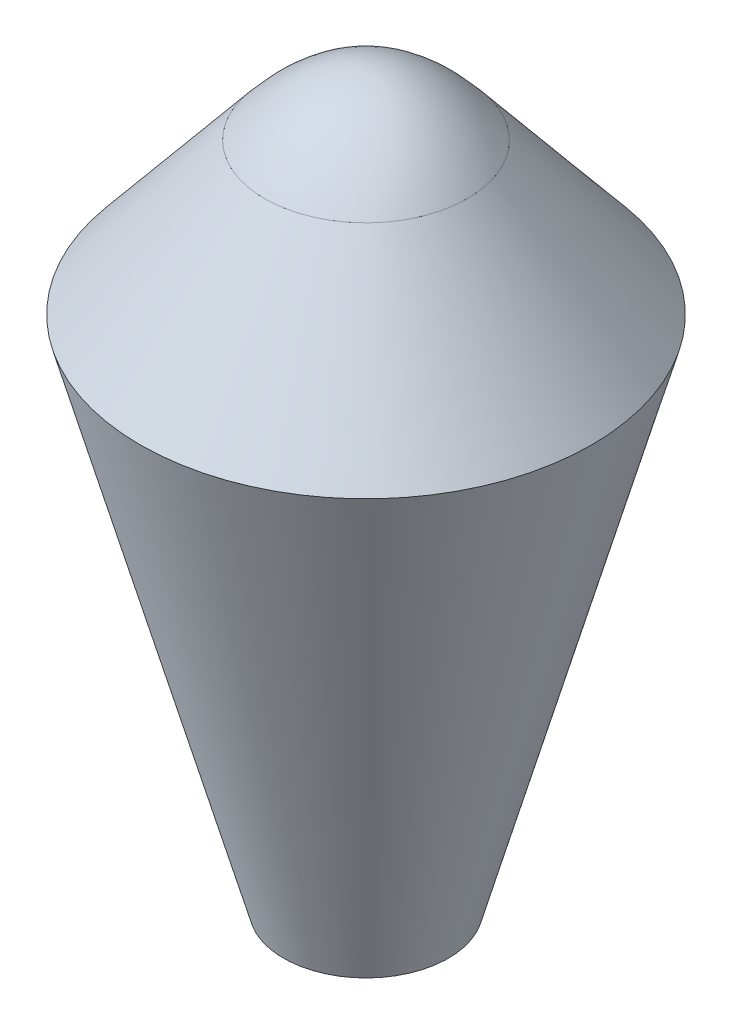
ISO-10303-21;
HEADER;
FILE_DESCRIPTION(('STEP AP214'),'2;1');
FILE_NAME('part.step','',(''),(''),'','','');
FILE_SCHEMA(('AUTOMOTIVE_DESIGN { 1 0 10303 214 1 1 1 1 }'));
ENDSEC;
DATA;
#1=APPLICATION_CONTEXT('core data for automotive mechanical design processes');
#2=APPLICATION_PROTOCOL_DEFINITION('international standard','automotive_design',2000,#1);
#3=PRODUCT_CONTEXT('',#1,'mechanical');
#4=PRODUCT('Part','Part','',(#3));
#5=PRODUCT_RELATED_PRODUCT_CATEGORY('part','',(#4));
#6=PRODUCT_DEFINITION_FORMATION('','',#4);
#7=PRODUCT_DEFINITION_CONTEXT('part definition',#1,'design');
#8=PRODUCT_DEFINITION('design','',#6,#7);
#9=PRODUCT_DEFINITION_SHAPE('','',#8);
#10=(LENGTH_UNIT() NAMED_UNIT(*) SI_UNIT(.MILLI.,.METRE.));
#11=(NAMED_UNIT(*) PLANE_ANGLE_UNIT() SI_UNIT($,.RADIAN.));
#12=(NAMED_UNIT(*) SI_UNIT($,.STERADIAN.) SOLID_ANGLE_UNIT());
#13=UNCERTAINTY_MEASURE_WITH_UNIT(LENGTH_MEASURE(1.E-05),#10,'distance_accuracy_value','');
#14=(GEOMETRIC_REPRESENTATION_CONTEXT(3) GLOBAL_UNCERTAINTY_ASSIGNED_CONTEXT((#13)) GLOBAL_UNIT_ASSIGNED_CONTEXT((#10,
#11,#12)) REPRESENTATION_CONTEXT('',''));
#15=CARTESIAN_POINT('',(0.,0.,0.));
#16=DIRECTION('',(0.,0.,1.));
#17=DIRECTION('',(1.,0.,0.));
#18=AXIS2_PLACEMENT_3D('',#15,#16,#17);
#19=CARTESIAN_POINT('',(-14.2559215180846,82.6136920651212,-14.4318182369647));
#20=CARTESIAN_POINT('',(-8.5535529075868,89.3983986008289,-14.4318182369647));
#21=CARTESIAN_POINT('',(-2.85118429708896,93.0930925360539,-14.4318182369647));
#22=CARTESIAN_POINT('',(2.85118431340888,93.0720125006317,-14.4318182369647));
#23=CARTESIAN_POINT('',(8.55355292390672,89.3990041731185,-14.4318182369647));
#24=CARTESIAN_POINT('',(14.2559215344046,82.6614479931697,-14.4318182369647));
#25=CARTESIAN_POINT('',(-14.2559215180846,89.5757486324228,-8.655165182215));
#26=CARTESIAN_POINT('',(-8.5535529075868,96.9048114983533,-8.655165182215));
#27=CARTESIAN_POINT('',(-2.85118429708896,100.302320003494,-8.655165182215));
#28=CARTESIAN_POINT('',(2.85118431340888,100.275838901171,-8.65516518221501));
#29=CARTESIAN_POINT('',(8.55355292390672,96.884088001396,-8.65516518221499));
#30=CARTESIAN_POINT('',(14.2559215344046,89.5838472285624,-8.655165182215));
#31=CARTESIAN_POINT('',(-14.2559215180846,93.3592027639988,-2.87851212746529));
#32=CARTESIAN_POINT('',(-8.5535529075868,100.377822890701,-2.87851212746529));
#33=CARTESIAN_POINT('',(-2.85118429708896,103.246310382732,-2.87851212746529));
#34=CARTESIAN_POINT('',(2.85118431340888,103.179594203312,-2.87851212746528));
#35=CARTESIAN_POINT('',(8.55355292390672,100.331467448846,-2.8785121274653));
#36=CARTESIAN_POINT('',(14.2559215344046,93.3337100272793,-2.87851212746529));
#37=CARTESIAN_POINT('',(-14.2559215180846,93.3444529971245,2.89814092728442));
#38=CARTESIAN_POINT('',(-8.5535529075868,100.371031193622,2.89814092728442));
#39=CARTESIAN_POINT('',(-2.85118429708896,103.205456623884,2.89814092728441));
#40=CARTESIAN_POINT('',(2.85118431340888,103.258325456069,2.89814092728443));
#41=CARTESIAN_POINT('',(8.55355292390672,100.400603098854,2.89814092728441));
#42=CARTESIAN_POINT('',(14.2559215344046,93.3631287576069,2.89814092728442));
#43=CARTESIAN_POINT('',(-14.2559215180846,89.5573572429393,8.67479398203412));
#44=CARTESIAN_POINT('',(-8.5535529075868,96.8645126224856,8.67479398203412));
#45=CARTESIAN_POINT('',(-2.85118429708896,100.264019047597,8.67479398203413));
#46=CARTESIAN_POINT('',(2.85118431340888,100.301314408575,8.67479398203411));
#47=CARTESIAN_POINT('',(8.55355292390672,96.8903892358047,8.67479398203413));
#48=CARTESIAN_POINT('',(14.2559215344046,89.5657791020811,8.67479398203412));
#49=CARTESIAN_POINT('',(-14.2559215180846,82.6217733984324,14.4514470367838));
#50=CARTESIAN_POINT('',(-8.5535529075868,89.3882817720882,14.4514470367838));
#51=CARTESIAN_POINT('',(-2.85118429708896,93.0341993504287,14.4514470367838));
#52=CARTESIAN_POINT('',(2.85118431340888,93.0764137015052,14.4514470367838));
#53=CARTESIAN_POINT('',(8.55355292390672,89.3744885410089,14.4514470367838));
#54=CARTESIAN_POINT('',(14.2559215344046,82.5669419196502,14.4514470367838));
#55=B_SPLINE_SURFACE_WITH_KNOTS('',5,5,((#19,#20,#21,#22,#23,#24),(#25,#26,#27,#28,#29,#30),
(#31,#32,#33,#34,#35,#36),(#37,#38,#39,#40,#41,#42),(#43,#44,#45,#46,#47,#48),(#49,#50,#51,#52,
#53,#54)),.UNSPECIFIED.,.F.,.F.,.F.,(6,6),(6,6),(-13.7340018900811,15.1492633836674),
(-14.2559215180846,14.2559215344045),.UNSPECIFIED.);
#56=CARTESIAN_POINT('',(0.,91.8666404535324,-13.9563269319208));
#57=CARTESIAN_POINT('',(-0.228357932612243,91.8666473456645,-13.9563303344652));
#58=CARTESIAN_POINT('',(-0.456715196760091,91.8666629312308,-13.950717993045));
#59=CARTESIAN_POINT('',(-0.912875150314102,91.866703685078,-13.9283004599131));
#60=CARTESIAN_POINT('',(-1.1406778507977,91.8667288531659,-13.9114954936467));
#61=CARTESIAN_POINT('',(-1.59517951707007,91.8667809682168,-13.8667318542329));
#62=CARTESIAN_POINT('',(-1.82187850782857,91.8668079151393,-13.8387734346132));
#63=CARTESIAN_POINT('',(-2.27362967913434,91.866861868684,-13.7717694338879));
#64=CARTESIAN_POINT('',(-2.49868187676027,91.8668888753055,-13.7327239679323));
#65=CARTESIAN_POINT('',(-2.94660115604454,91.8669414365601,-13.6436360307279));
#66=CARTESIAN_POINT('',(-3.16946821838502,91.8669669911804,-13.5935934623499));
#67=CARTESIAN_POINT('',(-3.61248304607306,91.8670139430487,-13.4826292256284));
#68=CARTESIAN_POINT('',(-3.83263074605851,91.8670353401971,-13.4217072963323));
#69=CARTESIAN_POINT('',(-4.2696761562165,91.8670674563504,-13.289132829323));
#70=CARTESIAN_POINT('',(-4.48657379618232,91.867078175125,-13.2174800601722));
#71=CARTESIAN_POINT('',(-4.91659064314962,91.8670815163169,-13.0636227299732));
#72=CARTESIAN_POINT('',(-5.12970989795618,91.8670741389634,-12.9814183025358));
#73=CARTESIAN_POINT('',(-5.5516484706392,91.8670468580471,-12.8066545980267));
#74=CARTESIAN_POINT('',(-5.7604679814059,91.8670269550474,-12.7140957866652));
#75=CARTESIAN_POINT('',(-6.17330513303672,91.8669782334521,-12.5188460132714));
#76=CARTESIAN_POINT('',(-6.37732296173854,91.8669494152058,-12.4161554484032));
#77=CARTESIAN_POINT('',(-6.7800719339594,91.8668855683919,-12.2008884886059));
#78=CARTESIAN_POINT('',(-6.97880313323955,91.8668505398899,-12.0883121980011));
#79=CARTESIAN_POINT('',(-7.3705080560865,91.8667762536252,-11.8535435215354));
#80=CARTESIAN_POINT('',(-7.56348165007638,91.8667369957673,-11.7313509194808));
#81=CARTESIAN_POINT('',(-7.94321138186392,91.8666573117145,-11.4776422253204));
#82=CARTESIAN_POINT('',(-8.12996725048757,91.8666168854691,-11.3461257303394));
#83=CARTESIAN_POINT('',(-8.4968090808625,91.8665421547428,-11.0740840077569));
#84=CARTESIAN_POINT('',(-8.6768947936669,91.8665078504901,-10.9335584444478));
#85=CARTESIAN_POINT('',(-9.02995018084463,91.8664598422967,-10.6438345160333));
#86=CARTESIAN_POINT('',(-9.20291983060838,91.8664461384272,-10.4946361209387));
#87=CARTESIAN_POINT('',(-9.541327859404,91.8664319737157,-10.1879356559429));
#88=CARTESIAN_POINT('',(-9.70676637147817,91.8664315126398,-10.030433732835));
#89=CARTESIAN_POINT('',(-10.0297149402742,91.8664425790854,-9.70750738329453));
#90=CARTESIAN_POINT('',(-10.1872251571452,91.8664541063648,-9.5420831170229));
#91=CARTESIAN_POINT('',(-10.4939387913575,91.8664894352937,-9.20370827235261));
#92=CARTESIAN_POINT('',(-10.6431422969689,91.8665132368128,-9.03075777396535));
#93=CARTESIAN_POINT('',(-10.9328838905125,91.866572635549,-8.67774295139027));
#94=CARTESIAN_POINT('',(-11.073421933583,91.8666082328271,-8.49767859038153));
#95=CARTESIAN_POINT('',(-11.3454947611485,91.8666879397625,-8.13086646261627));
#96=CARTESIAN_POINT('',(-11.4770293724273,91.8667320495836,-7.94411856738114));
#97=CARTESIAN_POINT('',(-11.7307789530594,91.8668219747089,-7.56438917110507));
#98=CARTESIAN_POINT('',(-11.8529937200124,91.8668677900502,-7.37140753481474));
#99=CARTESIAN_POINT('',(-12.0878122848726,91.8669494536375,-6.9796786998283));
#100=CARTESIAN_POINT('',(-12.2004159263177,91.8669853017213,-6.78093140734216));
#101=CARTESIAN_POINT('',(-12.415739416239,91.8670491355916,-6.37813946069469));
#102=CARTESIAN_POINT('',(-12.5184587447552,91.8670771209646,-6.17409452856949));
#103=CARTESIAN_POINT('',(-12.7137653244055,91.8671218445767,-5.76119628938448));
#104=CARTESIAN_POINT('',(-12.806351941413,91.8671385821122,-5.55234268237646));
#105=CARTESIAN_POINT('',(-12.9811676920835,91.8671563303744,-5.13033680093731));
#106=CARTESIAN_POINT('',(-13.0633964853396,91.8671573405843,-4.91718438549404));
#107=CARTESIAN_POINT('',(-13.2172953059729,91.8671423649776,-4.48710468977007));
#108=CARTESIAN_POINT('',(-13.288965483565,91.8671263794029,-4.27017746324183));
#109=CARTESIAN_POINT('',(-13.4215716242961,91.86708088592,-3.83307951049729));
#110=CARTESIAN_POINT('',(-13.4825081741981,91.8670513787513,-3.6129089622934));
#111=CARTESIAN_POINT('',(-13.5934992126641,91.8669862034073,-3.16985668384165));
#112=CARTESIAN_POINT('',(-13.6435543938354,91.8669505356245,-2.94697512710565));
#113=CARTESIAN_POINT('',(-13.7326632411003,91.8668816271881,-2.49903015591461));
#114=CARTESIAN_POINT('',(-13.7717172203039,91.8668483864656,-2.27396680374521));
#115=CARTESIAN_POINT('',(-13.8387349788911,91.8667844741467,-1.82220216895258));
#116=CARTESIAN_POINT('',(-13.8666991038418,91.8667538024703,-1.59550093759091));
#117=CARTESIAN_POINT('',(-13.9114716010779,91.8666989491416,-1.14100930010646));
#118=CARTESIAN_POINT('',(-13.9282804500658,91.866674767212,-0.913218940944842));
#119=CARTESIAN_POINT('',(-13.9507019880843,91.8666384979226,-0.457093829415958));
#120=CARTESIAN_POINT('',(-13.9563149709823,91.8666264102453,-0.228759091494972));
#121=CARTESIAN_POINT('',(-13.9563307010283,91.8666177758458,0.227911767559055));
#122=CARTESIAN_POINT('',(-13.950733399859,91.8666212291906,0.456247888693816));
#123=CARTESIAN_POINT('',(-13.9283414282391,91.8666432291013,0.912378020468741));
#124=CARTESIAN_POINT('',(-13.911546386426,91.8666617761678,1.14017201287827));
#125=CARTESIAN_POINT('',(-13.8667990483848,91.8667098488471,1.59467150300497));
#126=CARTESIAN_POINT('',(-13.8388462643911,91.8667393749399,1.82137695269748));
#127=CARTESIAN_POINT('',(-13.7718524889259,91.8668014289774,2.27314988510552));
#128=CARTESIAN_POINT('',(-13.7328111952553,91.8668339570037,2.49821732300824));
#129=CARTESIAN_POINT('',(-13.6437268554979,91.8669018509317,2.94618148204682));
#130=CARTESIAN_POINT('',(-13.5936830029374,91.8669372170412,3.16907804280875));
#131=CARTESIAN_POINT('',(-13.4827089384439,91.8670052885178,3.61217189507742));
#132=CARTESIAN_POINT('',(-13.4217774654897,91.8670379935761,3.83236887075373));
#133=CARTESIAN_POINT('',(-13.2891771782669,91.8670911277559,4.2695244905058));
#134=CARTESIAN_POINT('',(-13.217507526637,91.8671115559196,4.4864828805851));
#135=CARTESIAN_POINT('',(-13.0636086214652,91.8671346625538,4.91662110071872));
#136=CARTESIAN_POINT('',(-12.9813793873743,91.8671373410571,5.12980093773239));
#137=CARTESIAN_POINT('',(-12.8065650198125,91.8671253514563,5.5518512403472));
#138=CARTESIAN_POINT('',(-12.7139807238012,91.867110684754,5.76072205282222));
#139=CARTESIAN_POINT('',(-12.5186820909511,91.8670694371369,6.17364321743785));
#140=CARTESIAN_POINT('',(-12.4159689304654,91.8670428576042,6.37769412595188));
#141=CARTESIAN_POINT('',(-12.2006591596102,91.8669807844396,6.7804947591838));
#142=CARTESIAN_POINT('',(-12.0880632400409,91.8669452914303,6.97924485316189));
#143=CARTESIAN_POINT('',(-11.8532600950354,91.8668655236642,7.37097677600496));
#144=CARTESIAN_POINT('',(-11.73105313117,91.8668212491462,7.56395876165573));
#145=CARTESIAN_POINT('',(-11.4773232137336,91.8667330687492,7.94368595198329));
#146=CARTESIAN_POINT('',(-11.3458006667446,91.8666891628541,8.13043142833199));
#147=CARTESIAN_POINT('',(-11.0737552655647,91.8666095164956,8.49723802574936));
#148=CARTESIAN_POINT('',(-10.9332327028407,91.8665737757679,8.67729936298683));
#149=CARTESIAN_POINT('',(-10.6435224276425,91.8665160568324,9.03030967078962));
#150=CARTESIAN_POINT('',(-10.4943347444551,91.866494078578,9.20325866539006));
#151=CARTESIAN_POINT('',(-10.1876499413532,91.8664660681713,9.54163370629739));
#152=CARTESIAN_POINT('',(-10.0301525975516,91.8664600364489,9.70705954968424));
#153=CARTESIAN_POINT('',(-9.70722557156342,91.8664633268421,10.0299928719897));
#154=CARTESIAN_POINT('',(-9.54179554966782,91.8664726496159,10.1875000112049));
#155=CARTESIAN_POINT('',(-9.20340214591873,91.866505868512,10.4942132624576));
#156=CARTESIAN_POINT('',(-9.03043853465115,91.8665297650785,10.6434191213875));
#157=CARTESIAN_POINT('',(-8.67739039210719,91.8665932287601,10.9331669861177));
#158=CARTESIAN_POINT('',(-8.4973056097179,91.8666327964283,11.0737086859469));
#159=CARTESIAN_POINT('',(-8.13044192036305,91.8667197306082,11.3457954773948));
#160=CARTESIAN_POINT('',(-7.94366250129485,91.8667670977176,11.477339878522));
#161=CARTESIAN_POINT('',(-7.56386199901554,91.8668596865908,11.7311135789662));
#162=CARTESIAN_POINT('',(-7.37084051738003,91.8669049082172,11.8533422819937));
#163=CARTESIAN_POINT('',(-6.9790297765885,91.8669855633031,12.0881832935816));
#164=CARTESIAN_POINT('',(-6.78024043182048,91.8670209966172,12.2007954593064));
#165=CARTESIAN_POINT('',(-6.37738319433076,91.8670785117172,12.416124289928));
#166=CARTESIAN_POINT('',(-6.17331551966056,91.8671005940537,12.5188413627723));
#167=CARTESIAN_POINT('',(-5.76039997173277,91.8671313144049,12.7141279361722));
#168=CARTESIAN_POINT('',(-5.55155246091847,91.8671399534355,12.8066982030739));
#169=CARTESIAN_POINT('',(-5.12957878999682,91.8671430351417,12.9814715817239));
#170=CARTESIAN_POINT('',(-4.91645289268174,91.8671374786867,13.0636753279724));
#171=CARTESIAN_POINT('',(-4.48643079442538,91.8671069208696,13.2175279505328));
#172=CARTESIAN_POINT('',(-4.26953468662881,91.8670819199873,13.2891770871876));
#173=CARTESIAN_POINT('',(-3.83249772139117,91.8670224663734,13.4217428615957));
#174=CARTESIAN_POINT('',(-3.61235701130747,91.8669880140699,13.482659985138));
#175=CARTESIAN_POINT('',(-3.16936040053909,91.8669172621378,13.5936152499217));
#176=CARTESIAN_POINT('',(-2.94650461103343,91.8668809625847,13.6436538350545));
#177=CARTESIAN_POINT('',(-2.49860893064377,91.866811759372,13.7327350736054));
#178=CARTESIAN_POINT('',(-2.2735690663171,91.8667788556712,13.7717778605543));
#179=CARTESIAN_POINT('',(-1.82184015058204,91.8667192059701,13.8387776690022));
#180=CARTESIAN_POINT('',(-1.59515106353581,91.8666924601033,13.8667344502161));
#181=CARTESIAN_POINT('',(-1.14066464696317,91.8666472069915,13.9114967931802));
#182=CARTESIAN_POINT('',(-0.912867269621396,91.8666287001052,13.9283018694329));
#183=CARTESIAN_POINT('',(-0.45671337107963,91.8666044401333,13.9507171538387));
#184=CARTESIAN_POINT('',(-0.228356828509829,91.866598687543,13.9563269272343));
#185=CARTESIAN_POINT('',(0.22835628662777,91.8666118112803,13.9563269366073));
#186=CARTESIAN_POINT('',(0.456712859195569,91.8666306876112,13.9507171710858));
#187=CARTESIAN_POINT('',(0.912866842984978,91.8666784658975,13.9283018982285));
#188=CARTESIAN_POINT('',(1.14066427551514,91.8667073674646,13.911496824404));
#189=CARTESIAN_POINT('',(1.59515078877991,91.8667683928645,13.8667344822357));
#190=CARTESIAN_POINT('',(1.82183991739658,91.8668005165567,13.8387777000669));
#191=CARTESIAN_POINT('',(2.27356888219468,91.8668644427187,13.7717778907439));
#192=CARTESIAN_POINT('',(2.49860875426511,91.8668962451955,13.7327351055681));
#193=CARTESIAN_POINT('',(2.94650441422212,91.8669563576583,13.6436538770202));
#194=CARTESIAN_POINT('',(3.1693601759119,91.8669846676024,13.5936153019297));
#195=CARTESIAN_POINT('',(3.61235671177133,91.8670332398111,13.482660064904));
#196=CARTESIAN_POINT('',(3.83249737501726,91.8670535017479,13.4217429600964));
#197=CARTESIAN_POINT('',(4.26953426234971,91.8670800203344,13.2891772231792));
#198=CARTESIAN_POINT('',(4.48643033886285,91.8670862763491,13.2175281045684));
#199=CARTESIAN_POINT('',(4.9164524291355,91.867077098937,13.0636755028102));
#200=CARTESIAN_POINT('',(5.12957834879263,91.8670616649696,12.9814717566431));
#201=CARTESIAN_POINT('',(5.55155208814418,91.8670169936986,12.8066983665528));
#202=CARTESIAN_POINT('',(5.76039964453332,91.866987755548,12.7141280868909));
#203=CARTESIAN_POINT('',(6.17331526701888,91.866918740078,12.5188414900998));
#204=CARTESIAN_POINT('',(6.37738297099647,91.8668789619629,12.4161244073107));
#205=CARTESIAN_POINT('',(6.78024023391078,91.8667909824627,12.200795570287));
#206=CARTESIAN_POINT('',(6.97902957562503,91.8667427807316,12.0881834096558));
#207=CARTESIAN_POINT('',(7.37084028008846,91.8666428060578,11.8533424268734));
#208=CARTESIAN_POINT('',(7.56386172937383,91.8665910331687,11.7311137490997));
#209=CARTESIAN_POINT('',(7.94366215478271,91.8664920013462,11.4773401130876));
#210=CARTESIAN_POINT('',(8.1304415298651,91.8664447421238,11.3457957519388));
#211=CARTESIAN_POINT('',(8.49730514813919,91.8663643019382,11.073709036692));
#212=CARTESIAN_POINT('',(8.67738990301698,91.866331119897,10.9331673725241));
#213=CARTESIAN_POINT('',(9.03043803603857,91.8662856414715,10.643419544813));
#214=CARTESIAN_POINT('',(9.20340166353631,91.8662733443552,10.4942136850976));
#215=CARTESIAN_POINT('',(9.54179512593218,91.8662669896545,10.1875004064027));
#216=CARTESIAN_POINT('',(9.70722518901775,91.8662729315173,10.0299932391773));
#217=CARTESIAN_POINT('',(10.0301522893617,91.8663021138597,9.7070598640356));
#218=CARTESIAN_POINT('',(10.1876496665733,91.8663253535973,9.54163399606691));
#219=CARTESIAN_POINT('',(10.4943345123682,91.8663880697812,9.20325892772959));
#220=CARTESIAN_POINT('',(10.6435222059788,91.8664275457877,9.03030993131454));
#221=CARTESIAN_POINT('',(10.9332324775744,91.8665191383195,8.67729964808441));
#222=CARTESIAN_POINT('',(11.0737550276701,91.8665712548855,8.49723833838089));
#223=CARTESIAN_POINT('',(11.3458003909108,91.8666814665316,8.13043181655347));
#224=CARTESIAN_POINT('',(11.477322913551,91.8667395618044,7.94368638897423));
#225=CARTESIAN_POINT('',(11.7310527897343,91.8668532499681,7.56395929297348));
#226=CARTESIAN_POINT('',(11.853259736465,91.8669088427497,7.37097735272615));
#227=CARTESIAN_POINT('',(12.0880628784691,91.8670080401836,6.97924547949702));
#228=CARTESIAN_POINT('',(12.2006588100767,91.867051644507,6.78049538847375));
#229=CARTESIAN_POINT('',(12.4159686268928,91.8671267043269,6.37769472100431));
#230=CARTESIAN_POINT('',(12.5186818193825,91.8671581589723,6.17364377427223));
#231=CARTESIAN_POINT('',(12.7139805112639,91.8672060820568,5.76072253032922));
#232=CARTESIAN_POINT('',(12.8065648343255,91.8672225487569,5.55185167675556));
#233=CARTESIAN_POINT('',(12.9813792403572,91.8672353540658,5.12980131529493));
#234=CARTESIAN_POINT('',(13.0636084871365,91.8672316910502,4.91662146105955));
#235=CARTESIAN_POINT('',(13.2175074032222,91.8672042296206,4.48648324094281));
#236=CARTESIAN_POINT('',(13.289177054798,91.8671804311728,4.26952486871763));
#237=CARTESIAN_POINT('',(13.4217773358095,91.8671186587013,3.83236931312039));
#238=CARTESIAN_POINT('',(13.4827088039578,91.8670806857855,3.61217238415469));
#239=CARTESIAN_POINT('',(13.5936828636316,91.8670007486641,3.16907862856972));
#240=CARTESIAN_POINT('',(13.6437267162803,91.8669587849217,2.94618211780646));
#241=CARTESIAN_POINT('',(13.7328110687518,91.866877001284,2.49821801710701));
#242=CARTESIAN_POINT('',(13.7718523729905,91.8668371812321,2.27315058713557));
#243=CARTESIAN_POINT('',(13.8388461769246,91.8667605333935,1.82137761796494));
#244=CARTESIAN_POINT('',(13.8667989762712,91.8667237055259,1.59467212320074));
#245=CARTESIAN_POINT('',(13.9115463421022,91.8666617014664,1.14017253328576));
#246=CARTESIAN_POINT('',(13.9283413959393,91.8666365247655,0.912378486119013));
#247=CARTESIAN_POINT('',(13.9507333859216,91.8666025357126,0.456248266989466));
#248=CARTESIAN_POINT('',(13.9563306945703,91.8665937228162,0.227912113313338));
#249=CARTESIAN_POINT('',(13.9563149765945,91.8665933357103,-0.228758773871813));
#250=CARTESIAN_POINT('',(13.9507020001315,91.8666017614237,-0.457093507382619));
#251=CARTESIAN_POINT('',(13.9282804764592,91.8666325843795,-0.91321857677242));
#252=CARTESIAN_POINT('',(13.9114716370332,91.8666549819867,-1.14100889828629));
#253=CARTESIAN_POINT('',(13.8666991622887,91.8667080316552,-1.59550045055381));
#254=CARTESIAN_POINT('',(13.8387350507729,91.8667386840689,-1.82220163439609));
#255=CARTESIAN_POINT('',(13.771717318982,91.8668039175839,-2.27396620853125));
#256=CARTESIAN_POINT('',(13.7326633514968,91.8668384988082,-2.49902954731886));
#257=CARTESIAN_POINT('',(13.6435545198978,91.8669108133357,-2.94697454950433));
#258=CARTESIAN_POINT('',(13.5934993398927,91.8669485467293,-3.16985615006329));
#259=CARTESIAN_POINT('',(13.4825082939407,91.8670178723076,-3.6129085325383));
#260=CARTESIAN_POINT('',(13.4215717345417,91.8670494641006,-3.83307914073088));
#261=CARTESIAN_POINT('',(13.2889655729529,91.8670985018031,-4.27017719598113));
#262=CARTESIAN_POINT('',(13.217295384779,91.86711594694,-4.48710446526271));
#263=CARTESIAN_POINT('',(13.0633965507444,91.8671327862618,-4.91718421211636));
#264=CARTESIAN_POINT('',(12.9811677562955,91.8671321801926,-5.13033663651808));
#265=CARTESIAN_POINT('',(12.8063520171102,91.8671140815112,-5.55234250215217));
#266=CARTESIAN_POINT('',(12.7137654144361,91.8670965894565,-5.76119608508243));
#267=CARTESIAN_POINT('',(12.5184588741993,91.8670494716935,-6.17409426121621));
#268=CARTESIAN_POINT('',(12.4157395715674,91.8670198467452,-6.37813915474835));
#269=CARTESIAN_POINT('',(12.2004161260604,91.8669524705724,-6.78093104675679));
#270=CARTESIAN_POINT('',(12.087812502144,91.8669147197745,-6.97967832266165));
#271=CARTESIAN_POINT('',(11.8529939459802,91.8668298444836,-7.37140717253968));
#272=CARTESIAN_POINT('',(11.7307791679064,91.8667827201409,-7.5643888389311));
#273=CARTESIAN_POINT('',(11.4770295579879,91.8666916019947,-7.94411830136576));
#274=CARTESIAN_POINT('',(11.3454949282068,91.8666476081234,-8.13086623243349));
#275=CARTESIAN_POINT('',(11.0734220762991,91.866570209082,-8.49767840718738));
#276=CARTESIAN_POINT('',(10.9328840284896,91.866536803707,-8.67774278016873));
#277=CARTESIAN_POINT('',(10.6431424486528,91.8664841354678,-9.03075759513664));
#278=CARTESIAN_POINT('',(10.4939389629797,91.8664648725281,-9.20370807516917));
#279=CARTESIAN_POINT('',(10.187225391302,91.8664407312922,-9.54208286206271));
#280=CARTESIAN_POINT('',(10.0297152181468,91.866435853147,-9.70750708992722));
#281=CARTESIAN_POINT('',(9.70676674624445,91.8664394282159,-10.0304333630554));
#282=CARTESIAN_POINT('',(9.54132828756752,91.8664478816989,-10.1879352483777));
#283=CARTESIAN_POINT('',(9.20292034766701,91.8664781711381,-10.4946356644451));
#284=CARTESIAN_POINT('',(9.02995073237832,91.8665000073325,-10.6438340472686));
#285=CARTESIAN_POINT('',(8.67689536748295,91.8665629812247,-10.9335579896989));
#286=CARTESIAN_POINT('',(8.49680964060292,91.8666041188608,-11.0740835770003));
#287=CARTESIAN_POINT('',(8.12996776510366,91.8666898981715,-11.3461253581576));
#288=CARTESIAN_POINT('',(7.94321186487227,91.8667345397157,-11.477641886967));
#289=CARTESIAN_POINT('',(7.56348208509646,91.8668190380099,-11.7313506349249));
#290=CARTESIAN_POINT('',(7.37050847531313,91.8668588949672,-11.853543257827));
#291=CARTESIAN_POINT('',(6.97880355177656,91.8669303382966,-12.0883119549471));
#292=CARTESIAN_POINT('',(6.7800723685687,91.866961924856,-12.2008882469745));
#293=CARTESIAN_POINT('',(6.37732345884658,91.867015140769,-12.4161551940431));
#294=CARTESIAN_POINT('',(6.17330567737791,91.867036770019,-12.5188457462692));
#295=CARTESIAN_POINT('',(5.76046863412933,91.8670683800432,-12.7140954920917));
#296=CARTESIAN_POINT('',(5.55164918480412,91.8670783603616,-12.8066542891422));
#297=CARTESIAN_POINT('',(5.12971071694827,91.8670846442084,-12.981417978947));
#298=CARTESIAN_POINT('',(4.91659150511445,91.8670809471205,-13.0636224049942));
#299=CARTESIAN_POINT('',(4.4865746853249,91.8670561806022,-13.2174797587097));
#300=CARTESIAN_POINT('',(4.26967702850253,91.8670351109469,-13.2891325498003));
#301=CARTESIAN_POINT('',(3.83263152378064,91.8669848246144,-13.4217070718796));
#302=CARTESIAN_POINT('',(3.61248374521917,91.8669556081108,-13.4826290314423));
#303=CARTESIAN_POINT('',(3.16946873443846,91.8668969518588,-13.5935933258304));
#304=CARTESIAN_POINT('',(2.94660156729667,91.8668675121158,-13.6436359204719));
#305=CARTESIAN_POINT('',(2.49868209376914,91.8668118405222,-13.7327239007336));
#306=CARTESIAN_POINT('',(2.27362980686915,91.8667856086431,-13.7717693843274));
#307=CARTESIAN_POINT('',(1.82187850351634,91.866737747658,-13.838773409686));
#308=CARTESIAN_POINT('',(1.59517947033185,91.866716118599,-13.8667318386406));
#309=CARTESIAN_POINT('',(1.14067777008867,91.8666782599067,-13.9114954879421));
#310=CARTESIAN_POINT('',(0.912875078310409,91.8666620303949,-13.9283004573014));
#311=CARTESIAN_POINT('',(0.45671515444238,91.8666410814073,-13.9507179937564));
#312=CARTESIAN_POINT('',(0.228357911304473,91.8666363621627,-13.9563303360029));
#313=CARTESIAN_POINT('',(0.,91.8666404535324,-13.9563269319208));
#314=B_SPLINE_CURVE_WITH_KNOTS('',3,(#56,#57,#58,#59,#60,#61,#62,#63,#64,#65,#66,#67,#68,#69,
#70,#71,#72,#73,#74,#75,#76,#77,#78,#79,#80,#81,#82,#83,#84,#85,#86,#87,#88,#89,#90,#91,#92,#93,
#94,#95,#96,#97,#98,#99,#100,#101,#102,#103,#104,#105,#106,#107,#108,#109,#110,#111,#112,#113,
#114,#115,#116,#117,#118,#119,#120,#121,#122,#123,#124,#125,#126,#127,#128,#129,#130,#131,#132,
#133,#134,#135,#136,#137,#138,#139,#140,#141,#142,#143,#144,#145,#146,#147,#148,#149,#150,#151,
#152,#153,#154,#155,#156,#157,#158,#159,#160,#161,#162,#163,#164,#165,#166,#167,#168,#169,#170,
#171,#172,#173,#174,#175,#176,#177,#178,#179,#180,#181,#182,#183,#184,#185,#186,#187,#188,#189,
#190,#191,#192,#193,#194,#195,#196,#197,#198,#199,#200,#201,#202,#203,#204,#205,#206,#207,#208,
#209,#210,#211,#212,#213,#214,#215,#216,#217,#218,#219,#220,#221,#222,#223,#224,#225,#226,#227,
#228,#229,#230,#231,#232,#233,#234,#235,#236,#237,#238,#239,#240,#241,#242,#243,#244,#245,#246,
#247,#248,#249,#250,#251,#252,#253,#254,#255,#256,#257,#258,#259,#260,#261,#262,#263,#264,#265,
#266,#267,#268,#269,#270,#271,#272,#273,#274,#275,#276,#277,#278,#279,#280,#281,#282,#283,#284,
#285,#286,#287,#288,#289,#290,#291,#292,#293,#294,#295,#296,#297,#298,#299,#300,#301,#302,#303,
#304,#305,#306,#307,#308,#309,#310,#311,#312,#313),.UNSPECIFIED.,.F.,.F.,(4,2,2,2,2,2,2,2,2,2,2,
2,2,2,2,2,2,2,2,2,2,2,2,2,2,2,2,2,2,2,2,2,2,2,2,2,2,2,2,2,2,2,2,2,2,2,2,2,2,2,2,2,2,2,2,2,2,2,2,
2,2,2,2,2,2,2,2,2,2,2,2,2,2,2,2,2,2,2,2,2,2,2,2,2,2,2,2,2,2,2,2,2,2,2,2,2,2,2,2,2,2,2,2,2,2,2,2,
2,2,2,2,2,2,2,2,2,2,2,2,2,2,2,2,2,2,2,2,2,4),(0.,0.685003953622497,1.36999411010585,
2.05496869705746,2.73993617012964,3.42490969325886,4.10989964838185,4.79490437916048,
5.47990043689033,6.16486569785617,6.84980411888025,7.53473531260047,8.21968190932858,
8.90465811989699,9.58965986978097,10.274663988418,10.9596560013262,11.6446341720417,
12.3296050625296,13.0145794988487,13.6995671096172,14.3845695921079,15.0695832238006,
15.7546328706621,16.4397253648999,17.1248403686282,17.8099456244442,18.495013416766,
19.1800375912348,19.8650422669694,20.5500255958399,21.234979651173,21.9199157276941,
22.6048547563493,23.289816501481,23.9748081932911,24.6598185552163,25.3448791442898,
26.0300191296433,26.7152125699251,27.4004047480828,28.0855415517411,28.7705988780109,
29.455608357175,30.1405991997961,30.8255601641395,31.5104989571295,32.1954354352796,
32.8803903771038,33.5653746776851,34.2503798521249,34.9354092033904,35.6204910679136,
36.3056167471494,36.9907526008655,37.6758601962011,38.3609160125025,39.0459298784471,
39.7309268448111,40.4158927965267,41.1008307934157,41.7857604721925,42.4707049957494,
43.1556793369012,43.840680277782,44.5256813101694,45.2106558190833,45.8956004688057,
46.580530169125,47.2654680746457,47.9504338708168,48.6354307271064,49.320444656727,
50.0055006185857,50.6906083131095,51.3757441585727,52.0608697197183,52.7459514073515,
53.4309806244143,54.1159858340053,54.8009702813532,55.4859253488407,56.1708618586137,
56.8558005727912,57.5407613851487,58.2257520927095,58.9107615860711,59.5958190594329,
60.2809560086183,60.966148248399,61.6513416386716,62.3364814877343,63.021541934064,
63.7065522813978,64.3915441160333,65.0765060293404,65.7614451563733,66.4463812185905,
67.1313351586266,67.816318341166,68.5013229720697,69.1863472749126,69.8714152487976,
70.5565206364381,71.2416356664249,71.9267280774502,72.6117775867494,73.2967911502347,
73.9817937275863,74.6667814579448,75.3517559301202,76.0367267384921,76.7217047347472,
77.4066965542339,78.0917005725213,78.7767024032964,79.4616787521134,80.1466254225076,
80.8315565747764,81.516494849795,82.2014599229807,82.8864558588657,83.5714606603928,
84.2564508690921,84.941424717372,85.6263924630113,86.3113671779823,86.9963573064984,
87.681361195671),.UNSPECIFIED.);
#315=CARTESIAN_POINT('',(0.,91.8666404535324,-13.9563269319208));
#316=VERTEX_POINT('',#315);
#317=EDGE_CURVE('E12',#316,#316,#314,.F.);
#318=ORIENTED_EDGE('',*,*,#317,.F.);
#319=EDGE_LOOP('',(#318));
#320=FACE_BOUND('',#319,.T.);
#321=ADVANCED_FACE('F48',(#320),#55,.T.);
#322=OPEN_SHELL('',(#321));
#323=SHELL_BASED_SURFACE_MODEL('B2',(#322));
#324=CARTESIAN_POINT('',(6.61785085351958,0.,0.));
#325=DIRECTION('',(0.,-1.,0.));
#326=DIRECTION('',(0.,0.,-1.));
#327=AXIS2_PLACEMENT_3D('',#324,#325,#326);
#328=PLANE('',#327);
#329=CARTESIAN_POINT('',(0.,0.,0.));
#330=DIRECTION('',(0.,-1.,0.));
#331=DIRECTION('',(0.,0.,-1.));
#332=AXIS2_PLACEMENT_3D('',#329,#330,#331);
#333=CIRCLE('',#332,11.3512260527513);
#334=CARTESIAN_POINT('',(0.,0.,-11.3512260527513));
#335=VERTEX_POINT('',#334);
#336=EDGE_CURVE('E94',#335,#335,#333,.T.);
#337=ORIENTED_EDGE('',*,*,#336,.T.);
#338=EDGE_LOOP('',(#337));
#339=FACE_BOUND('',#338,.T.);
#340=CARTESIAN_POINT('',(0.,0.,0.));
#341=DIRECTION('',(0.,-1.,0.));
#342=DIRECTION('',(0.,0.,-1.));
#343=AXIS2_PLACEMENT_3D('',#340,#341,#342);
#344=CIRCLE('',#343,6.61785085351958);
#345=CARTESIAN_POINT('',(0.,0.,-6.61785085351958));
#346=VERTEX_POINT('',#345);
#347=EDGE_CURVE('E47',#346,#346,#344,.T.);
#348=ORIENTED_EDGE('',*,*,#347,.F.);
#349=EDGE_LOOP('',(#348));
#350=FACE_BOUND('',#349,.T.);
#351=ADVANCED_FACE('F80',(#339,#350),#328,.T.);
#352=CARTESIAN_POINT('',(0.,91.8668136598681,0.));
#353=DIRECTION('',(0.,1.,0.));
#354=DIRECTION('',(0.,0.,1.));
#355=AXIS2_PLACEMENT_3D('',#352,#353,#354);
#356=CONICAL_SURFACE('',#355,13.9563269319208,0.0797124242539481);
#357=ORIENTED_EDGE('',*,*,#347,.T.);
#358=EDGE_LOOP('',(#357));
#359=FACE_BOUND('',#358,.T.);
#360=CARTESIAN_POINT('',(0.,91.8668136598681,0.));
#361=DIRECTION('',(0.,-1.,0.));
#362=DIRECTION('',(0.,0.,-1.));
#363=AXIS2_PLACEMENT_3D('',#360,#361,#362);
#364=CIRCLE('',#363,13.9563269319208);
#365=CARTESIAN_POINT('',(0.,91.8668136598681,-13.9563269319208));
#366=VERTEX_POINT('',#365);
#367=EDGE_CURVE('E86',#366,#366,#364,.T.);
#368=ORIENTED_EDGE('',*,*,#367,.F.);
#369=EDGE_LOOP('',(#368));
#370=FACE_BOUND('',#369,.T.);
#371=ADVANCED_FACE('F110',(#359,#370),#356,.F.);
#372=CARTESIAN_POINT('',(0.,71.0777751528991,0.));
#373=DIRECTION('',(0.,-1.,0.));
#374=DIRECTION('',(0.,0.,-1.));
#375=AXIS2_PLACEMENT_3D('',#372,#373,#374);
#376=CONICAL_SURFACE('',#375,31.0880345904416,0.68924885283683);
#377=ORIENTED_EDGE('',*,*,#367,.T.);
#378=EDGE_LOOP('',(#377));
#379=FACE_BOUND('',#378,.T.);
#380=CARTESIAN_POINT('',(0.,71.0777751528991,0.));
#381=DIRECTION('',(0.,-1.,0.));
#382=DIRECTION('',(0.,0.,-1.));
#383=AXIS2_PLACEMENT_3D('',#380,#381,#382);
#384=CIRCLE('',#383,31.0880345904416);
#385=CARTESIAN_POINT('',(0.,71.0777751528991,-31.0880345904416));
#386=VERTEX_POINT('',#385);
#387=EDGE_CURVE('E90',#386,#386,#384,.T.);
#388=ORIENTED_EDGE('',*,*,#387,.F.);
#389=EDGE_LOOP('',(#388));
#390=FACE_BOUND('',#389,.T.);
#391=ADVANCED_FACE('F104',(#379,#390),#376,.T.);
#392=CARTESIAN_POINT('',(0.,0.,0.));
#393=DIRECTION('',(0.,1.,0.));
#394=DIRECTION('',(0.,0.,1.));
#395=AXIS2_PLACEMENT_3D('',#392,#393,#394);
#396=CONICAL_SURFACE('',#395,11.3512260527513,0.27085518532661);
#397=ORIENTED_EDGE('',*,*,#387,.T.);
#398=EDGE_LOOP('',(#397));
#399=FACE_BOUND('',#398,.T.);
#400=ORIENTED_EDGE('',*,*,#336,.F.);
#401=EDGE_LOOP('',(#400));
#402=FACE_BOUND('',#401,.T.);
#403=ADVANCED_FACE('F102',(#399,#402),#396,.T.);
#404=CLOSED_SHELL('',(#351,#371,#391,#403));
#405=MANIFOLD_SOLID_BREP('B7',#404);
#406=ADVANCED_BREP_SHAPE_REPRESENTATION('',(#18,#405),#14);
#407=MANIFOLD_SURFACE_SHAPE_REPRESENTATION('',(#18,#323),#14);
#408=SHAPE_REPRESENTATION('',(#18),#14);
#409=SHAPE_DEFINITION_REPRESENTATION(#9,#408);
#410=SHAPE_REPRESENTATION_RELATIONSHIP('','',#408,#406);
#411=SHAPE_REPRESENTATION_RELATIONSHIP('','',#408,#407);
ENDSEC;
END-ISO-10303-21;
